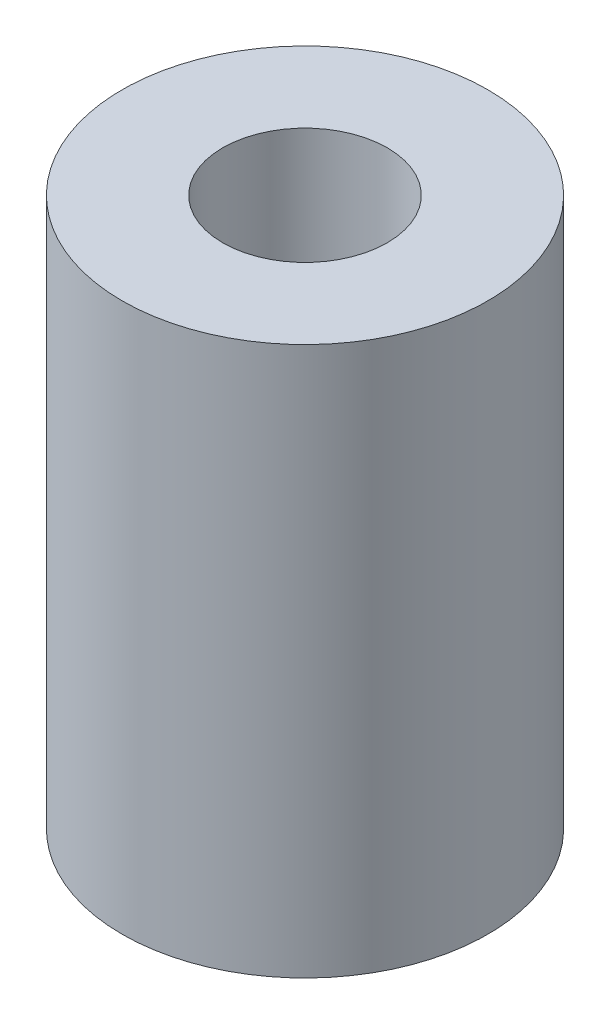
from build123d import *

# Parameters (mm, degrees)
ESQUISSE1_W = 2.75
ESQUISSE1_H = 15


with BuildPart() as part:
    # Esquisse1 → Base-R_volution (revolve)
    with BuildSketch(Plane.XY, mode=Mode.PRIVATE) as base_r_volution_sk:
        with Locations((3.625, 7.5)):
            Rectangle(ESQUISSE1_W, ESQUISSE1_H)
    revolve(base_r_volution_sk.sketch.rotate(Axis((0, 0, 0), (0, 1, 0)), 90), axis=Axis((0, 0, 0), (0, 1, 0)))


solid = part.part
